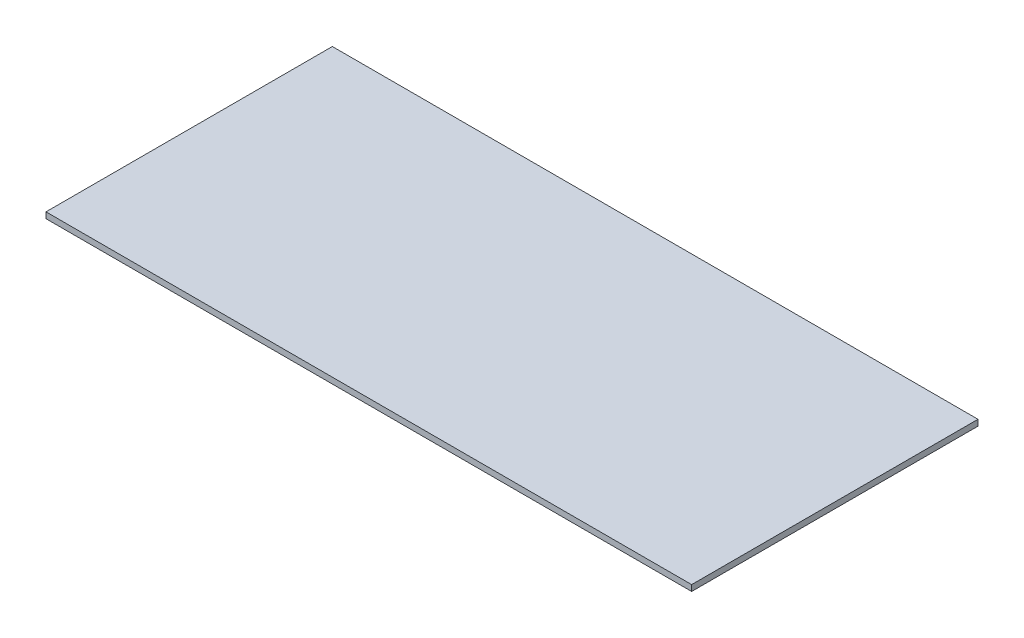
from build123d import *

# Parameters (mm, degrees)
SKETCH1_W      = 1371.6
SKETCH1_H      = 608.33
EXTRUDE1_DEPTH = 12.7


with BuildPart() as part:
    # Sketch1 → Extrude1 (new body)
    with BuildSketch(Plane(origin=(0, 0, 0), x_dir=(1, 0, 0), z_dir=(0, 1, 0))):
        with Locations((685.8, 304.165)):
            Rectangle(SKETCH1_W, SKETCH1_H)
    extrude(amount=-EXTRUDE1_DEPTH)


solid = part.part
